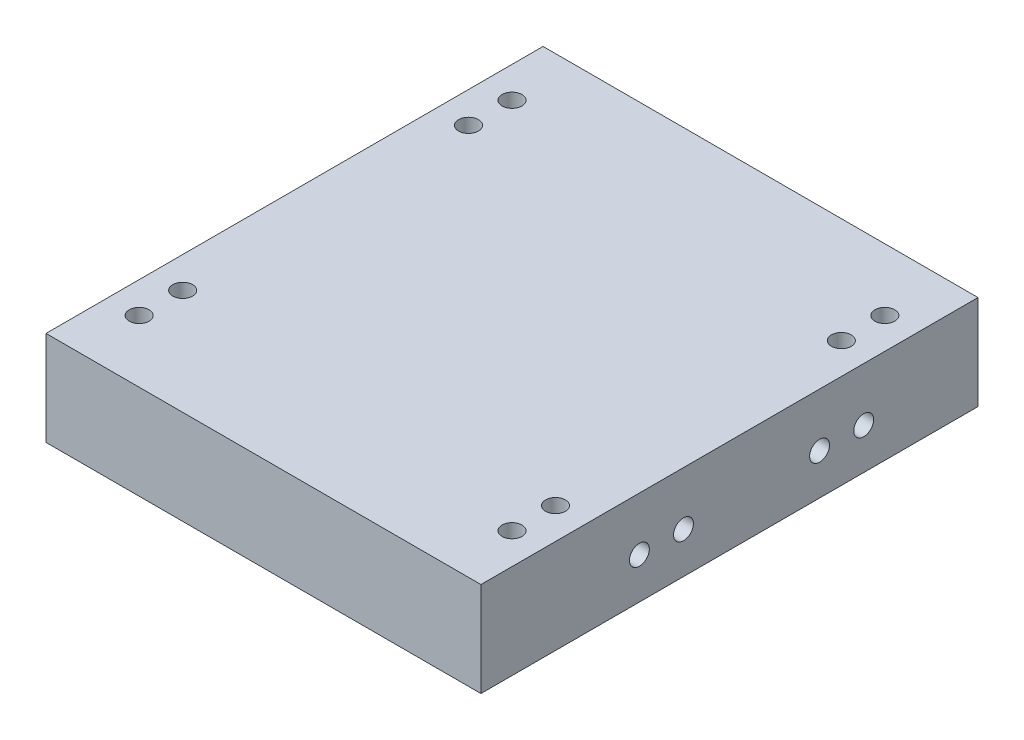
ISO-10303-21;
HEADER;
FILE_DESCRIPTION(('STEP AP214'),'2;1');
FILE_NAME('part.step','',(''),(''),'','','');
FILE_SCHEMA(('AUTOMOTIVE_DESIGN { 1 0 10303 214 1 1 1 1 }'));
ENDSEC;
DATA;
#1=APPLICATION_CONTEXT('core data for automotive mechanical design processes');
#2=APPLICATION_PROTOCOL_DEFINITION('international standard','automotive_design',2000,#1);
#3=PRODUCT_CONTEXT('',#1,'mechanical');
#4=PRODUCT('Part','Part','',(#3));
#5=PRODUCT_RELATED_PRODUCT_CATEGORY('part','',(#4));
#6=PRODUCT_DEFINITION_FORMATION('','',#4);
#7=PRODUCT_DEFINITION_CONTEXT('part definition',#1,'design');
#8=PRODUCT_DEFINITION('design','',#6,#7);
#9=PRODUCT_DEFINITION_SHAPE('','',#8);
#10=(LENGTH_UNIT() NAMED_UNIT(*) SI_UNIT(.MILLI.,.METRE.));
#11=(NAMED_UNIT(*) PLANE_ANGLE_UNIT() SI_UNIT($,.RADIAN.));
#12=(NAMED_UNIT(*) SI_UNIT($,.STERADIAN.) SOLID_ANGLE_UNIT());
#13=UNCERTAINTY_MEASURE_WITH_UNIT(LENGTH_MEASURE(1.E-05),#10,'distance_accuracy_value','');
#14=(GEOMETRIC_REPRESENTATION_CONTEXT(3) GLOBAL_UNCERTAINTY_ASSIGNED_CONTEXT((#13)) GLOBAL_UNIT_ASSIGNED_CONTEXT((#10,
#11,#12)) REPRESENTATION_CONTEXT('',''));
#15=CARTESIAN_POINT('',(0.,0.,0.));
#16=DIRECTION('',(0.,0.,1.));
#17=DIRECTION('',(1.,0.,0.));
#18=AXIS2_PLACEMENT_3D('',#15,#16,#17);
#19=CARTESIAN_POINT('',(22.225,9.652,-25.4));
#20=DIRECTION('',(-1.,0.,0.));
#21=DIRECTION('',(0.,0.,1.));
#22=AXIS2_PLACEMENT_3D('',#19,#20,#21);
#23=PLANE('',#22);
#24=CARTESIAN_POINT('',(22.225,4.19099999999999,9.2075));
#25=DIRECTION('',(1.,0.,0.));
#26=DIRECTION('',(0.,0.,-1.));
#27=AXIS2_PLACEMENT_3D('',#24,#25,#26);
#28=CIRCLE('',#27,1.016);
#29=CARTESIAN_POINT('',(22.225,4.19099999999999,8.1915));
#30=VERTEX_POINT('',#29);
#31=EDGE_CURVE('E163',#30,#30,#28,.T.);
#32=ORIENTED_EDGE('',*,*,#31,.F.);
#33=EDGE_LOOP('',(#32));
#34=FACE_BOUND('',#33,.T.);
#35=CARTESIAN_POINT('',(22.225,4.191,-9.2075));
#36=DIRECTION('',(1.,0.,0.));
#37=DIRECTION('',(0.,0.,-1.));
#38=AXIS2_PLACEMENT_3D('',#35,#36,#37);
#39=CIRCLE('',#38,1.016);
#40=CARTESIAN_POINT('',(22.225,4.191,-10.2235));
#41=VERTEX_POINT('',#40);
#42=EDGE_CURVE('E167',#41,#41,#39,.T.);
#43=ORIENTED_EDGE('',*,*,#42,.F.);
#44=EDGE_LOOP('',(#43));
#45=FACE_BOUND('',#44,.T.);
#46=CARTESIAN_POINT('',(22.225,4.191,4.699));
#47=DIRECTION('',(1.,0.,0.));
#48=DIRECTION('',(0.,0.,-1.));
#49=AXIS2_PLACEMENT_3D('',#46,#47,#48);
#50=CIRCLE('',#49,1.016);
#51=CARTESIAN_POINT('',(22.225,4.191,3.683));
#52=VERTEX_POINT('',#51);
#53=EDGE_CURVE('E171',#52,#52,#50,.T.);
#54=ORIENTED_EDGE('',*,*,#53,.F.);
#55=EDGE_LOOP('',(#54));
#56=FACE_BOUND('',#55,.T.);
#57=CARTESIAN_POINT('',(22.225,4.191,-13.716));
#58=DIRECTION('',(1.,0.,0.));
#59=DIRECTION('',(0.,0.,-1.));
#60=AXIS2_PLACEMENT_3D('',#57,#58,#59);
#61=CIRCLE('',#60,1.016);
#62=CARTESIAN_POINT('',(22.225,4.191,-14.732));
#63=VERTEX_POINT('',#62);
#64=EDGE_CURVE('E175',#63,#63,#61,.T.);
#65=ORIENTED_EDGE('',*,*,#64,.F.);
#66=EDGE_LOOP('',(#65));
#67=FACE_BOUND('',#66,.T.);
#68=DIRECTION('',(0.,0.,-1.));
#69=VECTOR('',#68,1.);
#70=CARTESIAN_POINT('',(22.225,0.,-25.4));
#71=LINE('',#70,#69);
#72=CARTESIAN_POINT('',(22.225,0.,25.4));
#73=VERTEX_POINT('',#72);
#74=CARTESIAN_POINT('',(22.225,0.,-25.4));
#75=VERTEX_POINT('',#74);
#76=EDGE_CURVE('E103',#73,#75,#71,.T.);
#77=ORIENTED_EDGE('',*,*,#76,.T.);
#78=DIRECTION('',(0.,-1.,0.));
#79=VECTOR('',#78,1.);
#80=CARTESIAN_POINT('',(22.225,9.652,-25.4));
#81=LINE('',#80,#79);
#82=CARTESIAN_POINT('',(22.225,9.652,-25.4));
#83=VERTEX_POINT('',#82);
#84=EDGE_CURVE('E11',#83,#75,#81,.T.);
#85=ORIENTED_EDGE('',*,*,#84,.F.);
#86=DIRECTION('',(0.,0.,-1.));
#87=VECTOR('',#86,1.);
#88=CARTESIAN_POINT('',(22.225,9.652,-25.4));
#89=LINE('',#88,#87);
#90=CARTESIAN_POINT('',(22.225,9.652,25.4));
#91=VERTEX_POINT('',#90);
#92=EDGE_CURVE('E90',#91,#83,#89,.T.);
#93=ORIENTED_EDGE('',*,*,#92,.F.);
#94=DIRECTION('',(0.,-1.,0.));
#95=VECTOR('',#94,1.);
#96=CARTESIAN_POINT('',(22.225,9.652,25.4));
#97=LINE('',#96,#95);
#98=EDGE_CURVE('E99',#91,#73,#97,.T.);
#99=ORIENTED_EDGE('',*,*,#98,.T.);
#100=EDGE_LOOP('',(#77,#85,#93,#99));
#101=FACE_BOUND('',#100,.T.);
#102=ADVANCED_FACE('F33',(#34,#45,#56,#67,#101),#23,.F.);
#103=CARTESIAN_POINT('',(-22.225,9.652,-25.4));
#104=DIRECTION('',(0.,0.,1.));
#105=DIRECTION('',(1.,0.,0.));
#106=AXIS2_PLACEMENT_3D('',#103,#104,#105);
#107=PLANE('',#106);
#108=DIRECTION('',(-1.,0.,0.));
#109=VECTOR('',#108,1.);
#110=CARTESIAN_POINT('',(-22.225,0.,-25.4));
#111=LINE('',#110,#109);
#112=CARTESIAN_POINT('',(-22.225,0.,-25.4));
#113=VERTEX_POINT('',#112);
#114=EDGE_CURVE('E94',#75,#113,#111,.T.);
#115=ORIENTED_EDGE('',*,*,#114,.T.);
#116=DIRECTION('',(0.,-1.,0.));
#117=VECTOR('',#116,1.);
#118=CARTESIAN_POINT('',(-22.225,9.652,-25.4));
#119=LINE('',#118,#117);
#120=CARTESIAN_POINT('',(-22.225,9.652,-25.4));
#121=VERTEX_POINT('',#120);
#122=EDGE_CURVE('E46',#121,#113,#119,.T.);
#123=ORIENTED_EDGE('',*,*,#122,.F.);
#124=DIRECTION('',(-1.,0.,0.));
#125=VECTOR('',#124,1.);
#126=CARTESIAN_POINT('',(-22.225,9.652,-25.4));
#127=LINE('',#126,#125);
#128=EDGE_CURVE('E85',#83,#121,#127,.T.);
#129=ORIENTED_EDGE('',*,*,#128,.F.);
#130=ORIENTED_EDGE('',*,*,#84,.T.);
#131=EDGE_LOOP('',(#115,#123,#129,#130));
#132=FACE_BOUND('',#131,.T.);
#133=ADVANCED_FACE('F93',(#132),#107,.F.);
#134=CARTESIAN_POINT('',(-22.225,9.652,-25.4));
#135=DIRECTION('',(1.,0.,0.));
#136=DIRECTION('',(0.,0.,-1.));
#137=AXIS2_PLACEMENT_3D('',#134,#135,#136);
#138=PLANE('',#137);
#139=CARTESIAN_POINT('',(-22.225,4.191,-9.2075));
#140=DIRECTION('',(-1.,0.,0.));
#141=DIRECTION('',(0.,0.,1.));
#142=AXIS2_PLACEMENT_3D('',#139,#140,#141);
#143=CIRCLE('',#142,1.016);
#144=CARTESIAN_POINT('',(-22.225,4.191,-8.1915));
#145=VERTEX_POINT('',#144);
#146=EDGE_CURVE('E205',#145,#145,#143,.T.);
#147=ORIENTED_EDGE('',*,*,#146,.F.);
#148=EDGE_LOOP('',(#147));
#149=FACE_BOUND('',#148,.T.);
#150=CARTESIAN_POINT('',(-22.225,4.191,9.2075));
#151=DIRECTION('',(-1.,0.,0.));
#152=DIRECTION('',(0.,0.,1.));
#153=AXIS2_PLACEMENT_3D('',#150,#151,#152);
#154=CIRCLE('',#153,1.016);
#155=CARTESIAN_POINT('',(-22.225,4.191,10.2235));
#156=VERTEX_POINT('',#155);
#157=EDGE_CURVE('E209',#156,#156,#154,.T.);
#158=ORIENTED_EDGE('',*,*,#157,.F.);
#159=EDGE_LOOP('',(#158));
#160=FACE_BOUND('',#159,.T.);
#161=CARTESIAN_POINT('',(-22.225,4.191,4.699));
#162=DIRECTION('',(-1.,0.,0.));
#163=DIRECTION('',(0.,0.,1.));
#164=AXIS2_PLACEMENT_3D('',#161,#162,#163);
#165=CIRCLE('',#164,1.016);
#166=CARTESIAN_POINT('',(-22.225,4.191,5.715));
#167=VERTEX_POINT('',#166);
#168=EDGE_CURVE('E213',#167,#167,#165,.T.);
#169=ORIENTED_EDGE('',*,*,#168,.F.);
#170=EDGE_LOOP('',(#169));
#171=FACE_BOUND('',#170,.T.);
#172=CARTESIAN_POINT('',(-22.225,4.191,-13.716));
#173=DIRECTION('',(-1.,0.,0.));
#174=DIRECTION('',(0.,0.,1.));
#175=AXIS2_PLACEMENT_3D('',#172,#173,#174);
#176=CIRCLE('',#175,1.016);
#177=CARTESIAN_POINT('',(-22.225,4.191,-12.7));
#178=VERTEX_POINT('',#177);
#179=EDGE_CURVE('E216',#178,#178,#176,.T.);
#180=ORIENTED_EDGE('',*,*,#179,.F.);
#181=EDGE_LOOP('',(#180));
#182=FACE_BOUND('',#181,.T.);
#183=DIRECTION('',(0.,0.,1.));
#184=VECTOR('',#183,1.);
#185=CARTESIAN_POINT('',(-22.225,0.,-25.4));
#186=LINE('',#185,#184);
#187=CARTESIAN_POINT('',(-22.225,0.,25.4));
#188=VERTEX_POINT('',#187);
#189=EDGE_CURVE('E72',#113,#188,#186,.T.);
#190=ORIENTED_EDGE('',*,*,#189,.T.);
#191=DIRECTION('',(0.,-1.,0.));
#192=VECTOR('',#191,1.);
#193=CARTESIAN_POINT('',(-22.225,9.652,25.4));
#194=LINE('',#193,#192);
#195=CARTESIAN_POINT('',(-22.225,9.652,25.4));
#196=VERTEX_POINT('',#195);
#197=EDGE_CURVE('E95',#196,#188,#194,.T.);
#198=ORIENTED_EDGE('',*,*,#197,.F.);
#199=DIRECTION('',(0.,0.,1.));
#200=VECTOR('',#199,1.);
#201=CARTESIAN_POINT('',(-22.225,9.652,-25.4));
#202=LINE('',#201,#200);
#203=EDGE_CURVE('E88',#121,#196,#202,.T.);
#204=ORIENTED_EDGE('',*,*,#203,.F.);
#205=ORIENTED_EDGE('',*,*,#122,.T.);
#206=EDGE_LOOP('',(#190,#198,#204,#205));
#207=FACE_BOUND('',#206,.T.);
#208=ADVANCED_FACE('F97',(#149,#160,#171,#182,#207),#138,.F.);
#209=CARTESIAN_POINT('',(-22.225,9.652,25.4));
#210=DIRECTION('',(0.,0.,-1.));
#211=DIRECTION('',(-1.,0.,0.));
#212=AXIS2_PLACEMENT_3D('',#209,#210,#211);
#213=PLANE('',#212);
#214=DIRECTION('',(1.,0.,0.));
#215=VECTOR('',#214,1.);
#216=CARTESIAN_POINT('',(-22.225,0.,25.4));
#217=LINE('',#216,#215);
#218=EDGE_CURVE('E78',#188,#73,#217,.T.);
#219=ORIENTED_EDGE('',*,*,#218,.T.);
#220=ORIENTED_EDGE('',*,*,#98,.F.);
#221=DIRECTION('',(1.,0.,0.));
#222=VECTOR('',#221,1.);
#223=CARTESIAN_POINT('',(-22.225,9.652,25.4));
#224=LINE('',#223,#222);
#225=EDGE_CURVE('E55',#196,#91,#224,.T.);
#226=ORIENTED_EDGE('',*,*,#225,.F.);
#227=ORIENTED_EDGE('',*,*,#197,.T.);
#228=EDGE_LOOP('',(#219,#220,#226,#227));
#229=FACE_BOUND('',#228,.T.);
#230=ADVANCED_FACE('F190',(#229),#213,.F.);
#231=CARTESIAN_POINT('',(0.,9.652,0.));
#232=DIRECTION('',(0.,1.,0.));
#233=DIRECTION('',(0.,0.,1.));
#234=AXIS2_PLACEMENT_3D('',#231,#232,#233);
#235=PLANE('',#234);
#236=CARTESIAN_POINT('',(-19.05,9.652,14.605));
#237=DIRECTION('',(0.,1.,0.));
#238=DIRECTION('',(0.,0.,1.));
#239=AXIS2_PLACEMENT_3D('',#236,#237,#238);
#240=CIRCLE('',#239,1.016);
#241=CARTESIAN_POINT('',(-19.05,9.652,15.621));
#242=VERTEX_POINT('',#241);
#243=EDGE_CURVE('E272',#242,#242,#240,.T.);
#244=ORIENTED_EDGE('',*,*,#243,.F.);
#245=EDGE_LOOP('',(#244));
#246=FACE_BOUND('',#245,.T.);
#247=CARTESIAN_POINT('',(19.05,9.652,-14.605));
#248=DIRECTION('',(0.,1.,0.));
#249=DIRECTION('',(0.,0.,1.));
#250=AXIS2_PLACEMENT_3D('',#247,#248,#249);
#251=CIRCLE('',#250,1.016);
#252=CARTESIAN_POINT('',(19.05,9.652,-13.589));
#253=VERTEX_POINT('',#252);
#254=EDGE_CURVE('E278',#253,#253,#251,.T.);
#255=ORIENTED_EDGE('',*,*,#254,.F.);
#256=EDGE_LOOP('',(#255));
#257=FACE_BOUND('',#256,.T.);
#258=CARTESIAN_POINT('',(-19.05,9.652,-14.605));
#259=DIRECTION('',(0.,1.,0.));
#260=DIRECTION('',(0.,0.,1.));
#261=AXIS2_PLACEMENT_3D('',#258,#259,#260);
#262=CIRCLE('',#261,1.016);
#263=CARTESIAN_POINT('',(-19.05,9.652,-13.589));
#264=VERTEX_POINT('',#263);
#265=EDGE_CURVE('E284',#264,#264,#262,.T.);
#266=ORIENTED_EDGE('',*,*,#265,.F.);
#267=EDGE_LOOP('',(#266));
#268=FACE_BOUND('',#267,.T.);
#269=CARTESIAN_POINT('',(19.05,9.652,14.605));
#270=DIRECTION('',(0.,1.,0.));
#271=DIRECTION('',(0.,0.,1.));
#272=AXIS2_PLACEMENT_3D('',#269,#270,#271);
#273=CIRCLE('',#272,1.016);
#274=CARTESIAN_POINT('',(19.05,9.652,15.621));
#275=VERTEX_POINT('',#274);
#276=EDGE_CURVE('E266',#275,#275,#273,.T.);
#277=ORIENTED_EDGE('',*,*,#276,.F.);
#278=EDGE_LOOP('',(#277));
#279=FACE_BOUND('',#278,.T.);
#280=CARTESIAN_POINT('',(19.05,9.652,19.05));
#281=DIRECTION('',(0.,1.,0.));
#282=DIRECTION('',(0.,0.,1.));
#283=AXIS2_PLACEMENT_3D('',#280,#281,#282);
#284=CIRCLE('',#283,1.016);
#285=CARTESIAN_POINT('',(19.05,9.652,20.066));
#286=VERTEX_POINT('',#285);
#287=EDGE_CURVE('E243',#286,#286,#284,.T.);
#288=ORIENTED_EDGE('',*,*,#287,.F.);
#289=EDGE_LOOP('',(#288));
#290=FACE_BOUND('',#289,.T.);
#291=CARTESIAN_POINT('',(19.05,9.652,-19.05));
#292=DIRECTION('',(0.,1.,0.));
#293=DIRECTION('',(0.,0.,1.));
#294=AXIS2_PLACEMENT_3D('',#291,#292,#293);
#295=CIRCLE('',#294,1.016);
#296=CARTESIAN_POINT('',(19.05,9.652,-18.034));
#297=VERTEX_POINT('',#296);
#298=EDGE_CURVE('E237',#297,#297,#295,.T.);
#299=ORIENTED_EDGE('',*,*,#298,.F.);
#300=EDGE_LOOP('',(#299));
#301=FACE_BOUND('',#300,.T.);
#302=CARTESIAN_POINT('',(-19.05,9.652,-19.05));
#303=DIRECTION('',(0.,1.,0.));
#304=DIRECTION('',(0.,0.,1.));
#305=AXIS2_PLACEMENT_3D('',#302,#303,#304);
#306=CIRCLE('',#305,1.016);
#307=CARTESIAN_POINT('',(-19.05,9.652,-18.034));
#308=VERTEX_POINT('',#307);
#309=EDGE_CURVE('E231',#308,#308,#306,.T.);
#310=ORIENTED_EDGE('',*,*,#309,.F.);
#311=EDGE_LOOP('',(#310));
#312=FACE_BOUND('',#311,.T.);
#313=CARTESIAN_POINT('',(-19.05,9.652,19.05));
#314=DIRECTION('',(0.,1.,0.));
#315=DIRECTION('',(0.,0.,1.));
#316=AXIS2_PLACEMENT_3D('',#313,#314,#315);
#317=CIRCLE('',#316,1.016);
#318=CARTESIAN_POINT('',(-19.05,9.652,20.066));
#319=VERTEX_POINT('',#318);
#320=EDGE_CURVE('E230',#319,#319,#317,.T.);
#321=ORIENTED_EDGE('',*,*,#320,.F.);
#322=EDGE_LOOP('',(#321));
#323=FACE_BOUND('',#322,.T.);
#324=ORIENTED_EDGE('',*,*,#92,.T.);
#325=ORIENTED_EDGE('',*,*,#128,.T.);
#326=ORIENTED_EDGE('',*,*,#203,.T.);
#327=ORIENTED_EDGE('',*,*,#225,.T.);
#328=EDGE_LOOP('',(#324,#325,#326,#327));
#329=FACE_BOUND('',#328,.T.);
#330=ADVANCED_FACE('F86',(#246,#257,#268,#279,#290,#301,#312,#323,#329),#235,.T.);
#331=CARTESIAN_POINT('',(0.,0.,0.));
#332=DIRECTION('',(0.,1.,0.));
#333=DIRECTION('',(0.,0.,1.));
#334=AXIS2_PLACEMENT_3D('',#331,#332,#333);
#335=PLANE('',#334);
#336=CARTESIAN_POINT('',(-19.05,0.,14.605));
#337=DIRECTION('',(0.,1.,0.));
#338=DIRECTION('',(0.,0.,1.));
#339=AXIS2_PLACEMENT_3D('',#336,#337,#338);
#340=CIRCLE('',#339,1.016);
#341=CARTESIAN_POINT('',(-19.05,0.,15.621));
#342=VERTEX_POINT('',#341);
#343=EDGE_CURVE('E275',#342,#342,#340,.T.);
#344=ORIENTED_EDGE('',*,*,#343,.T.);
#345=EDGE_LOOP('',(#344));
#346=FACE_BOUND('',#345,.T.);
#347=CARTESIAN_POINT('',(19.05,0.,-14.605));
#348=DIRECTION('',(0.,1.,0.));
#349=DIRECTION('',(0.,0.,1.));
#350=AXIS2_PLACEMENT_3D('',#347,#348,#349);
#351=CIRCLE('',#350,1.016);
#352=CARTESIAN_POINT('',(19.05,0.,-13.589));
#353=VERTEX_POINT('',#352);
#354=EDGE_CURVE('E281',#353,#353,#351,.T.);
#355=ORIENTED_EDGE('',*,*,#354,.T.);
#356=EDGE_LOOP('',(#355));
#357=FACE_BOUND('',#356,.T.);
#358=CARTESIAN_POINT('',(-19.05,0.,-14.605));
#359=DIRECTION('',(0.,1.,0.));
#360=DIRECTION('',(0.,0.,1.));
#361=AXIS2_PLACEMENT_3D('',#358,#359,#360);
#362=CIRCLE('',#361,1.016);
#363=CARTESIAN_POINT('',(-19.05,0.,-13.589));
#364=VERTEX_POINT('',#363);
#365=EDGE_CURVE('E269',#364,#364,#362,.T.);
#366=ORIENTED_EDGE('',*,*,#365,.T.);
#367=EDGE_LOOP('',(#366));
#368=FACE_BOUND('',#367,.T.);
#369=CARTESIAN_POINT('',(19.05,0.,14.605));
#370=DIRECTION('',(0.,1.,0.));
#371=DIRECTION('',(0.,0.,1.));
#372=AXIS2_PLACEMENT_3D('',#369,#370,#371);
#373=CIRCLE('',#372,1.016);
#374=CARTESIAN_POINT('',(19.05,0.,15.621));
#375=VERTEX_POINT('',#374);
#376=EDGE_CURVE('E117',#375,#375,#373,.T.);
#377=ORIENTED_EDGE('',*,*,#376,.T.);
#378=EDGE_LOOP('',(#377));
#379=FACE_BOUND('',#378,.T.);
#380=CARTESIAN_POINT('',(19.05,0.,19.05));
#381=DIRECTION('',(0.,1.,0.));
#382=DIRECTION('',(0.,0.,1.));
#383=AXIS2_PLACEMENT_3D('',#380,#381,#382);
#384=CIRCLE('',#383,1.016);
#385=CARTESIAN_POINT('',(19.05,0.,20.066));
#386=VERTEX_POINT('',#385);
#387=EDGE_CURVE('E240',#386,#386,#384,.T.);
#388=ORIENTED_EDGE('',*,*,#387,.T.);
#389=EDGE_LOOP('',(#388));
#390=FACE_BOUND('',#389,.T.);
#391=CARTESIAN_POINT('',(19.05,0.,-19.05));
#392=DIRECTION('',(0.,1.,0.));
#393=DIRECTION('',(0.,0.,1.));
#394=AXIS2_PLACEMENT_3D('',#391,#392,#393);
#395=CIRCLE('',#394,1.016);
#396=CARTESIAN_POINT('',(19.05,0.,-18.034));
#397=VERTEX_POINT('',#396);
#398=EDGE_CURVE('E234',#397,#397,#395,.T.);
#399=ORIENTED_EDGE('',*,*,#398,.T.);
#400=EDGE_LOOP('',(#399));
#401=FACE_BOUND('',#400,.T.);
#402=CARTESIAN_POINT('',(-19.05,0.,-19.05));
#403=DIRECTION('',(0.,1.,0.));
#404=DIRECTION('',(0.,0.,1.));
#405=AXIS2_PLACEMENT_3D('',#402,#403,#404);
#406=CIRCLE('',#405,1.016);
#407=CARTESIAN_POINT('',(-19.05,0.,-18.034));
#408=VERTEX_POINT('',#407);
#409=EDGE_CURVE('E227',#408,#408,#406,.T.);
#410=ORIENTED_EDGE('',*,*,#409,.T.);
#411=EDGE_LOOP('',(#410));
#412=FACE_BOUND('',#411,.T.);
#413=CARTESIAN_POINT('',(-19.05,0.,19.05));
#414=DIRECTION('',(0.,1.,0.));
#415=DIRECTION('',(0.,0.,1.));
#416=AXIS2_PLACEMENT_3D('',#413,#414,#415);
#417=CIRCLE('',#416,1.016);
#418=CARTESIAN_POINT('',(-19.05,0.,20.066));
#419=VERTEX_POINT('',#418);
#420=EDGE_CURVE('E106',#419,#419,#417,.T.);
#421=ORIENTED_EDGE('',*,*,#420,.T.);
#422=EDGE_LOOP('',(#421));
#423=FACE_BOUND('',#422,.T.);
#424=ORIENTED_EDGE('',*,*,#76,.F.);
#425=ORIENTED_EDGE('',*,*,#218,.F.);
#426=ORIENTED_EDGE('',*,*,#189,.F.);
#427=ORIENTED_EDGE('',*,*,#114,.F.);
#428=EDGE_LOOP('',(#424,#425,#426,#427));
#429=FACE_BOUND('',#428,.T.);
#430=ADVANCED_FACE('F178',(#346,#357,#368,#379,#390,#401,#412,#423,#429),#335,.F.);
#431=CARTESIAN_POINT('',(-19.05,0.,19.05));
#432=DIRECTION('',(0.,1.,0.));
#433=DIRECTION('',(0.,0.,1.));
#434=AXIS2_PLACEMENT_3D('',#431,#432,#433);
#435=CYLINDRICAL_SURFACE('',#434,1.016);
#436=ORIENTED_EDGE('',*,*,#420,.F.);
#437=EDGE_LOOP('',(#436));
#438=FACE_BOUND('',#437,.T.);
#439=ORIENTED_EDGE('',*,*,#320,.T.);
#440=EDGE_LOOP('',(#439));
#441=FACE_BOUND('',#440,.T.);
#442=ADVANCED_FACE('F180',(#438,#441),#435,.F.);
#443=CARTESIAN_POINT('',(-19.05,0.,-19.05));
#444=DIRECTION('',(0.,1.,0.));
#445=DIRECTION('',(0.,0.,1.));
#446=AXIS2_PLACEMENT_3D('',#443,#444,#445);
#447=CYLINDRICAL_SURFACE('',#446,1.016);
#448=ORIENTED_EDGE('',*,*,#409,.F.);
#449=EDGE_LOOP('',(#448));
#450=FACE_BOUND('',#449,.T.);
#451=ORIENTED_EDGE('',*,*,#309,.T.);
#452=EDGE_LOOP('',(#451));
#453=FACE_BOUND('',#452,.T.);
#454=ADVANCED_FACE('F187',(#450,#453),#447,.F.);
#455=CARTESIAN_POINT('',(19.05,0.,-19.05));
#456=DIRECTION('',(0.,1.,0.));
#457=DIRECTION('',(0.,0.,1.));
#458=AXIS2_PLACEMENT_3D('',#455,#456,#457);
#459=CYLINDRICAL_SURFACE('',#458,1.016);
#460=ORIENTED_EDGE('',*,*,#398,.F.);
#461=EDGE_LOOP('',(#460));
#462=FACE_BOUND('',#461,.T.);
#463=ORIENTED_EDGE('',*,*,#298,.T.);
#464=EDGE_LOOP('',(#463));
#465=FACE_BOUND('',#464,.T.);
#466=ADVANCED_FACE('F467',(#462,#465),#459,.F.);
#467=CARTESIAN_POINT('',(19.05,0.,19.05));
#468=DIRECTION('',(0.,1.,0.));
#469=DIRECTION('',(0.,0.,1.));
#470=AXIS2_PLACEMENT_3D('',#467,#468,#469);
#471=CYLINDRICAL_SURFACE('',#470,1.016);
#472=ORIENTED_EDGE('',*,*,#387,.F.);
#473=EDGE_LOOP('',(#472));
#474=FACE_BOUND('',#473,.T.);
#475=ORIENTED_EDGE('',*,*,#287,.T.);
#476=EDGE_LOOP('',(#475));
#477=FACE_BOUND('',#476,.T.);
#478=ADVANCED_FACE('F460',(#474,#477),#471,.F.);
#479=CARTESIAN_POINT('',(-12.065,4.191,-13.716));
#480=DIRECTION('',(-1.,0.,0.));
#481=DIRECTION('',(0.,0.,1.));
#482=AXIS2_PLACEMENT_3D('',#479,#480,#481);
#483=CYLINDRICAL_SURFACE('',#482,1.016);
#484=CARTESIAN_POINT('',(-19.05,3.18296875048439,-13.589));
#485=CARTESIAN_POINT('',(-19.1069224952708,3.18296383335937,-13.5890028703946));
#486=CARTESIAN_POINT('',(-19.1639101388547,3.18232753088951,-13.5938030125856));
#487=CARTESIAN_POINT('',(-19.2763399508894,3.18020247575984,-13.6128862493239));
#488=CARTESIAN_POINT('',(-19.3317786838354,3.17871196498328,-13.6271889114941));
#489=CARTESIAN_POINT('',(-19.4394718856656,3.17611161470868,-13.6648833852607));
#490=CARTESIAN_POINT('',(-19.4917276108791,3.1750016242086,-13.6882715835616));
#491=CARTESIAN_POINT('',(-19.5915812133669,3.17499838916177,-13.7434911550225));
#492=CARTESIAN_POINT('',(-19.6391805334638,3.17610445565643,-13.7753199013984));
#493=CARTESIAN_POINT('',(-19.7272690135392,3.18269790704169,-13.8456139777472));
#494=CARTESIAN_POINT('',(-19.7678874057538,3.18809200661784,-13.8839244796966));
#495=CARTESIAN_POINT('',(-19.8416950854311,3.20532062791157,-13.9658605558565));
#496=CARTESIAN_POINT('',(-19.8748974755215,3.21714366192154,-14.0094765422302));
#497=CARTESIAN_POINT('',(-19.9288149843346,3.24667302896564,-14.0930757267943));
#498=CARTESIAN_POINT('',(-19.9506232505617,3.26333617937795,-14.1327239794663));
#499=CARTESIAN_POINT('',(-19.9878468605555,3.30308483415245,-14.2117983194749));
#500=CARTESIAN_POINT('',(-20.0032637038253,3.32616882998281,-14.2512244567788));
#501=CARTESIAN_POINT('',(-20.0271360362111,3.37611302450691,-14.3242734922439));
#502=CARTESIAN_POINT('',(-20.03609440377,3.40244404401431,-14.358098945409));
#503=CARTESIAN_POINT('',(-20.0500315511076,3.45964673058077,-14.4225670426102));
#504=CARTESIAN_POINT('',(-20.0550092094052,3.49051967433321,-14.4532087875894));
#505=CARTESIAN_POINT('',(-20.0622838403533,3.55880520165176,-14.5127448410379));
#506=CARTESIAN_POINT('',(-20.0643285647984,3.59654600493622,-14.5412918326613));
#507=CARTESIAN_POINT('',(-20.0662562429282,3.67566921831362,-14.5928837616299));
#508=CARTESIAN_POINT('',(-20.0661378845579,3.7170538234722,-14.6159253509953));
#509=CARTESIAN_POINT('',(-20.0648298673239,3.80876741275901,-14.6589059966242));
#510=CARTESIAN_POINT('',(-20.063488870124,3.85952758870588,-14.6779249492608));
#511=CARTESIAN_POINT('',(-20.0609108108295,3.96342732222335,-14.7076595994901));
#512=CARTESIAN_POINT('',(-20.0596737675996,4.01656730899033,-14.7183737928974));
#513=CARTESIAN_POINT('',(-20.0581085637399,4.12692476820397,-14.7315823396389));
#514=CARTESIAN_POINT('',(-20.057835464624,4.18420341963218,-14.7335802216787));
#515=CARTESIAN_POINT('',(-20.058538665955,4.2982770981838,-14.7279339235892));
#516=CARTESIAN_POINT('',(-20.0595151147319,4.35507206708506,-14.7202885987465));
#517=CARTESIAN_POINT('',(-20.0620218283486,4.46624019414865,-14.6956541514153));
#518=CARTESIAN_POINT('',(-20.0635489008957,4.52062532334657,-14.6787186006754));
#519=CARTESIAN_POINT('',(-20.0657514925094,4.62585616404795,-14.6359901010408));
#520=CARTESIAN_POINT('',(-20.0664266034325,4.67670016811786,-14.6101929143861));
#521=CARTESIAN_POINT('',(-20.0649718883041,4.7735222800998,-14.5503685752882));
#522=CARTESIAN_POINT('',(-20.0628327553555,4.81948369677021,-14.5163144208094));
#523=CARTESIAN_POINT('',(-20.0534304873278,4.90474337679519,-14.4412839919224));
#524=CARTESIAN_POINT('',(-20.0461746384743,4.94405101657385,-14.4003176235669));
#525=CARTESIAN_POINT('',(-20.0254608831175,5.010941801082,-14.3180532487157));
#526=CARTESIAN_POINT('',(-20.0127161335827,5.03931430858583,-14.2772210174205));
#527=CARTESIAN_POINT('',(-19.9802275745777,5.08883428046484,-14.1940042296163));
#528=CARTESIAN_POINT('',(-19.960490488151,5.10998864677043,-14.1516211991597));
#529=CARTESIAN_POINT('',(-19.9169129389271,5.14282610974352,-14.0735435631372));
#530=CARTESIAN_POINT('',(-19.8939729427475,5.15539697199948,-14.0377118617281));
#531=CARTESIAN_POINT('',(-19.8430030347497,5.17581142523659,-13.9684053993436));
#532=CARTESIAN_POINT('',(-19.8149717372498,5.18365372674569,-13.9349312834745));
#533=CARTESIAN_POINT('',(-19.7537263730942,5.19568060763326,-13.8708069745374));
#534=CARTESIAN_POINT('',(-19.720404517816,5.19977335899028,-13.8402433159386));
#535=CARTESIAN_POINT('',(-19.6498551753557,5.20513748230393,-13.7837351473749));
#536=CARTESIAN_POINT('',(-19.6126258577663,5.20640752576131,-13.7577928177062));
#537=CARTESIAN_POINT('',(-19.5295365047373,5.20731763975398,-13.7077983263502));
#538=CARTESIAN_POINT('',(-19.4832003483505,5.20670194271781,-13.6845316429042));
#539=CARTESIAN_POINT('',(-19.3875384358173,5.20472856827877,-13.6453125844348));
#540=CARTESIAN_POINT('',(-19.338211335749,5.20337055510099,-13.6293635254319));
#541=CARTESIAN_POINT('',(-19.2328084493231,5.2008954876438,-13.6039754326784));
#542=CARTESIAN_POINT('',(-19.1765417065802,5.19981450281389,-13.595316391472));
#543=CARTESIAN_POINT('',(-19.0633470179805,5.19884951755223,-13.5875044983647));
#544=CARTESIAN_POINT('',(-19.0064190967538,5.19896547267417,-13.588351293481));
#545=CARTESIAN_POINT('',(-18.8934441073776,5.20031721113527,-13.5995287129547));
#546=CARTESIAN_POINT('',(-18.8373982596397,5.2015544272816,-13.6098714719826));
#547=CARTESIAN_POINT('',(-18.7277976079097,5.20424622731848,-13.6397692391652));
#548=CARTESIAN_POINT('',(-18.6742440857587,5.20570092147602,-13.6593289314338));
#549=CARTESIAN_POINT('',(-18.5707885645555,5.20724695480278,-13.7072896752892));
#550=CARTESIAN_POINT('',(-18.5209127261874,5.20732931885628,-13.7357476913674));
#551=CARTESIAN_POINT('',(-18.4267306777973,5.20398946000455,-13.8006041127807));
#552=CARTESIAN_POINT('',(-18.3824212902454,5.20056924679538,-13.836997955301));
#553=CARTESIAN_POINT('',(-18.3031760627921,5.18822635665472,-13.914064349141));
#554=CARTESIAN_POINT('',(-18.2678582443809,5.17961727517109,-13.9543906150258));
#555=CARTESIAN_POINT('',(-18.204834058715,5.15538375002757,-14.038689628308));
#556=CARTESIAN_POINT('',(-18.1771151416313,5.13977098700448,-14.0826562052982));
#557=CARTESIAN_POINT('',(-18.1333418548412,5.10346777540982,-14.1647365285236));
#558=CARTESIAN_POINT('',(-18.116164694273,5.08388098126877,-14.2027459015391));
#559=CARTESIAN_POINT('',(-18.0874219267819,5.03890823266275,-14.277431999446));
#560=CARTESIAN_POINT('',(-18.0758570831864,5.01352149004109,-14.3141085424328));
#561=CARTESIAN_POINT('',(-18.0579347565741,4.95860804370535,-14.3830061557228));
#562=CARTESIAN_POINT('',(-18.0513827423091,4.92929444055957,-14.4153484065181));
#563=CARTESIAN_POINT('',(-18.0417233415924,4.86645724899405,-14.4762166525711));
#564=CARTESIAN_POINT('',(-18.0386170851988,4.83293228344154,-14.5047413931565));
#565=CARTESIAN_POINT('',(-18.0345555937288,4.75825568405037,-14.5603277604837));
#566=CARTESIAN_POINT('',(-18.0338945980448,4.71667065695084,-14.5868275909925));
#567=CARTESIAN_POINT('',(-18.0341318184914,4.63010274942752,-14.6335337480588));
#568=CARTESIAN_POINT('',(-18.0350309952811,4.58511779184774,-14.6537361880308));
#569=CARTESIAN_POINT('',(-18.0373469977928,4.48670519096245,-14.6896005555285));
#570=CARTESIAN_POINT('',(-18.0388157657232,4.43293847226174,-14.7043361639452));
#571=CARTESIAN_POINT('',(-18.0410378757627,4.3237099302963,-14.7248274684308));
#572=CARTESIAN_POINT('',(-18.0417912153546,4.26824810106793,-14.7305831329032));
#573=CARTESIAN_POINT('',(-18.0420918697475,4.15568105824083,-14.7329847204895));
#574=CARTESIAN_POINT('',(-18.0416074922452,4.09857043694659,-14.7293912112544));
#575=CARTESIAN_POINT('',(-18.0396891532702,3.98576276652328,-14.7126880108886));
#576=CARTESIAN_POINT('',(-18.0382548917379,3.93006616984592,-14.6995753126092));
#577=CARTESIAN_POINT('',(-18.035574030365,3.82172066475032,-14.6642257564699));
#578=CARTESIAN_POINT('',(-18.0343271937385,3.7690679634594,-14.6420005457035));
#579=CARTESIAN_POINT('',(-18.0337815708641,3.66819050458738,-14.5890234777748));
#580=CARTESIAN_POINT('',(-18.0344831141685,3.61996649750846,-14.5582701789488));
#581=CARTESIAN_POINT('',(-18.0399845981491,3.53013994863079,-14.4897320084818));
#582=CARTESIAN_POINT('',(-18.0447236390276,3.48844985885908,-14.4520581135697));
#583=CARTESIAN_POINT('',(-18.0604455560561,3.41240129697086,-14.3710645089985));
#584=CARTESIAN_POINT('',(-18.0714170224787,3.37802958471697,-14.3277552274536));
#585=CARTESIAN_POINT('',(-18.0993705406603,3.32178162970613,-14.2441198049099));
#586=CARTESIAN_POINT('',(-18.1153524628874,3.29884901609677,-14.2041693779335));
#587=CARTESIAN_POINT('',(-18.1538674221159,3.2595442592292,-14.1242024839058));
#588=CARTESIAN_POINT('',(-18.1763983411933,3.24316999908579,-14.0841860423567));
#589=CARTESIAN_POINT('',(-18.2252326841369,3.21781985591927,-14.0102031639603));
#590=CARTESIAN_POINT('',(-18.2509353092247,3.20826875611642,-13.9760314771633));
#591=CARTESIAN_POINT('',(-18.3069662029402,3.19327305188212,-13.9107314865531));
#592=CARTESIAN_POINT('',(-18.33729540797,3.1878292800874,-13.8796038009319));
#593=CARTESIAN_POINT('',(-18.404235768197,3.17976664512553,-13.8192388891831));
#594=CARTESIAN_POINT('',(-18.4411421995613,3.17737977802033,-13.7902998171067));
#595=CARTESIAN_POINT('',(-18.5186596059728,3.17489134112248,-13.737745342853));
#596=CARTESIAN_POINT('',(-18.5592740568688,3.17479193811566,-13.7141350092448));
#597=CARTESIAN_POINT('',(-18.6494855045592,3.17577581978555,-13.6697322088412));
#598=CARTESIAN_POINT('',(-18.6995295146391,3.17703334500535,-13.6498500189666));
#599=CARTESIAN_POINT('',(-18.8020728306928,3.17958683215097,-13.6182580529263));
#600=CARTESIAN_POINT('',(-18.8545684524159,3.18088273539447,-13.6065364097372));
#601=CARTESIAN_POINT('',(-18.9311961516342,3.18214436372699,-13.5956881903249));
#602=CARTESIAN_POINT('',(-18.9548837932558,3.18244910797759,-13.5931821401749));
#603=CARTESIAN_POINT('',(-19.0023771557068,3.1828623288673,-13.5898374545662));
#604=CARTESIAN_POINT('',(-19.0261828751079,3.18297080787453,-13.588998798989));
#605=CARTESIAN_POINT('',(-19.05,3.18296875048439,-13.589));
#606=B_SPLINE_CURVE_WITH_KNOTS('',3,(#484,#485,#486,#487,#488,#489,#490,#491,#492,#493,#494,
#495,#496,#497,#498,#499,#500,#501,#502,#503,#504,#505,#506,#507,#508,#509,#510,#511,#512,#513,
#514,#515,#516,#517,#518,#519,#520,#521,#522,#523,#524,#525,#526,#527,#528,#529,#530,#531,#532,
#533,#534,#535,#536,#537,#538,#539,#540,#541,#542,#543,#544,#545,#546,#547,#548,#549,#550,#551,
#552,#553,#554,#555,#556,#557,#558,#559,#560,#561,#562,#563,#564,#565,#566,#567,#568,#569,#570,
#571,#572,#573,#574,#575,#576,#577,#578,#579,#580,#581,#582,#583,#584,#585,#586,#587,#588,#589,
#590,#591,#592,#593,#594,#595,#596,#597,#598,#599,#600,#601,#602,#603,#604,#605),.UNSPECIFIED.,
.T.,.F.,(4,2,2,2,2,2,2,2,2,2,2,2,2,2,2,2,2,2,2,2,2,2,2,2,2,2,2,2,2,2,2,2,2,2,2,2,2,2,2,2,2,2,2,
2,2,2,2,2,2,2,2,2,2,2,2,2,2,2,2,2,4),(0.,0.170678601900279,0.341709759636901,0.512672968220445,
0.683583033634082,0.850873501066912,1.01786601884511,1.16170175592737,1.30550372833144,
1.43632112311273,1.56717535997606,1.70872079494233,1.85035208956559,2.01231347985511,
2.17430419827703,2.34541041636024,2.51653694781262,2.68668690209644,2.85691833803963,
3.02771415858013,3.19826725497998,3.35131172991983,3.50420945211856,3.63668054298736,
3.76918774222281,3.90485952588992,4.04059514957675,4.19551670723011,4.35050839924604,
4.52050935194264,4.69050399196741,4.86071616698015,5.03101493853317,5.20242703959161,
5.37374084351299,5.53561450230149,5.69721918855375,5.83473713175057,5.97227377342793,
6.10415623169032,6.23608192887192,6.38344514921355,6.53089913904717,6.69744121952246,
6.86398388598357,7.03483344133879,7.20573699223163,7.37642278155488,7.54713744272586,
7.71532180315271,7.88319925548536,8.02862414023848,8.17400204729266,8.30487310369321,
8.43577068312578,8.57610674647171,8.7165757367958,8.87748935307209,9.03816847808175,
9.10958352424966,9.18099770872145),.UNSPECIFIED.);
#607=CARTESIAN_POINT('',(-19.05,3.18296875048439,-13.589));
#608=VERTEX_POINT('',#607);
#609=EDGE_CURVE('E36',#608,#608,#606,.T.);
#610=ORIENTED_EDGE('',*,*,#609,.T.);
#611=EDGE_LOOP('',(#610));
#612=FACE_BOUND('',#611,.T.);
#613=CARTESIAN_POINT('',(-12.065,4.191,-13.716));
#614=DIRECTION('',(-1.,0.,0.));
#615=DIRECTION('',(0.,0.,1.));
#616=AXIS2_PLACEMENT_3D('',#613,#614,#615);
#617=CIRCLE('',#616,1.016);
#618=CARTESIAN_POINT('',(-12.065,4.191,-12.7));
#619=VERTEX_POINT('',#618);
#620=EDGE_CURVE('E218',#619,#619,#617,.T.);
#621=ORIENTED_EDGE('',*,*,#620,.F.);
#622=EDGE_LOOP('',(#621));
#623=FACE_BOUND('',#622,.T.);
#624=ORIENTED_EDGE('',*,*,#179,.T.);
#625=EDGE_LOOP('',(#624));
#626=FACE_BOUND('',#625,.T.);
#627=ADVANCED_FACE('F451',(#612,#623,#626),#483,.F.);
#628=CARTESIAN_POINT('',(-12.065,4.191,-13.716));
#629=DIRECTION('',(-1.,0.,0.));
#630=DIRECTION('',(0.,0.,1.));
#631=AXIS2_PLACEMENT_3D('',#628,#629,#630);
#632=PLANE('',#631);
#633=ORIENTED_EDGE('',*,*,#620,.T.);
#634=EDGE_LOOP('',(#633));
#635=FACE_BOUND('',#634,.T.);
#636=ADVANCED_FACE('F442',(#635),#632,.T.);
#637=CARTESIAN_POINT('',(-12.065,4.191,4.699));
#638=DIRECTION('',(-1.,0.,0.));
#639=DIRECTION('',(0.,0.,1.));
#640=AXIS2_PLACEMENT_3D('',#637,#638,#639);
#641=CYLINDRICAL_SURFACE('',#640,1.016);
#642=CARTESIAN_POINT('',(-12.065,4.191,4.699));
#643=DIRECTION('',(-1.,0.,0.));
#644=DIRECTION('',(0.,0.,1.));
#645=AXIS2_PLACEMENT_3D('',#642,#643,#644);
#646=CIRCLE('',#645,1.016);
#647=CARTESIAN_POINT('',(-12.065,4.191,5.715));
#648=VERTEX_POINT('',#647);
#649=EDGE_CURVE('E246',#648,#648,#646,.T.);
#650=ORIENTED_EDGE('',*,*,#649,.F.);
#651=EDGE_LOOP('',(#650));
#652=FACE_BOUND('',#651,.T.);
#653=ORIENTED_EDGE('',*,*,#168,.T.);
#654=EDGE_LOOP('',(#653));
#655=FACE_BOUND('',#654,.T.);
#656=ADVANCED_FACE('F435',(#652,#655),#641,.F.);
#657=CARTESIAN_POINT('',(-12.065,4.191,4.699));
#658=DIRECTION('',(-1.,0.,0.));
#659=DIRECTION('',(0.,0.,1.));
#660=AXIS2_PLACEMENT_3D('',#657,#658,#659);
#661=PLANE('',#660);
#662=ORIENTED_EDGE('',*,*,#649,.T.);
#663=EDGE_LOOP('',(#662));
#664=FACE_BOUND('',#663,.T.);
#665=ADVANCED_FACE('F152',(#664),#661,.T.);
#666=CARTESIAN_POINT('',(12.065,4.191,-13.716));
#667=DIRECTION('',(1.,0.,0.));
#668=DIRECTION('',(0.,0.,-1.));
#669=AXIS2_PLACEMENT_3D('',#666,#667,#668);
#670=CYLINDRICAL_SURFACE('',#669,1.016);
#671=CARTESIAN_POINT('',(18.0419687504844,4.191,-14.732));
#672=CARTESIAN_POINT('',(18.0419638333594,4.24792249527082,-14.7319971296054));
#673=CARTESIAN_POINT('',(18.0413275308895,4.30491013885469,-14.7271969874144));
#674=CARTESIAN_POINT('',(18.0392024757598,4.41733995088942,-14.7081137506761));
#675=CARTESIAN_POINT('',(18.0377119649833,4.47277868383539,-14.6938110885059));
#676=CARTESIAN_POINT('',(18.0351116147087,4.58047188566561,-14.6561166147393));
#677=CARTESIAN_POINT('',(18.0340016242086,4.6327276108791,-14.6327284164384));
#678=CARTESIAN_POINT('',(18.0339983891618,4.73258121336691,-14.5775088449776));
#679=CARTESIAN_POINT('',(18.0351044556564,4.78018053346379,-14.5456800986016));
#680=CARTESIAN_POINT('',(18.0416979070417,4.86826901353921,-14.4753860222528));
#681=CARTESIAN_POINT('',(18.0470920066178,4.9088874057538,-14.4370755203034));
#682=CARTESIAN_POINT('',(18.0643206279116,4.98269508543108,-14.3551394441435));
#683=CARTESIAN_POINT('',(18.0761436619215,5.01589747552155,-14.3115234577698));
#684=CARTESIAN_POINT('',(18.1056730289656,5.06981498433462,-14.2279242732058));
#685=CARTESIAN_POINT('',(18.1223361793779,5.09162325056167,-14.1882760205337));
#686=CARTESIAN_POINT('',(18.1620848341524,5.12884686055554,-14.1092016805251));
#687=CARTESIAN_POINT('',(18.1851688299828,5.14426370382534,-14.0697755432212));
#688=CARTESIAN_POINT('',(18.2351130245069,5.16813603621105,-13.9967265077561));
#689=CARTESIAN_POINT('',(18.2614440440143,5.17709440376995,-13.962901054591));
#690=CARTESIAN_POINT('',(18.3186467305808,5.19103155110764,-13.8984329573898));
#691=CARTESIAN_POINT('',(18.3495196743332,5.19600920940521,-13.8677912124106));
#692=CARTESIAN_POINT('',(18.4178052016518,5.20328384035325,-13.8082551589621));
#693=CARTESIAN_POINT('',(18.4555460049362,5.2053285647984,-13.7797081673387));
#694=CARTESIAN_POINT('',(18.5346692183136,5.20725624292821,-13.7281162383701));
#695=CARTESIAN_POINT('',(18.5760538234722,5.20713788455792,-13.7050746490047));
#696=CARTESIAN_POINT('',(18.667767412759,5.20582986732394,-13.6620940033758));
#697=CARTESIAN_POINT('',(18.7185275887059,5.20448887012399,-13.6430750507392));
#698=CARTESIAN_POINT('',(18.8224273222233,5.20191081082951,-13.6133404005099));
#699=CARTESIAN_POINT('',(18.8755673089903,5.20067376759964,-13.6026262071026));
#700=CARTESIAN_POINT('',(18.985924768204,5.19910856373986,-13.5894176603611));
#701=CARTESIAN_POINT('',(19.0432034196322,5.19883546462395,-13.5874197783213));
#702=CARTESIAN_POINT('',(19.1572770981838,5.19953866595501,-13.5930660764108));
#703=CARTESIAN_POINT('',(19.2140720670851,5.20051511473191,-13.6007114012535));
#704=CARTESIAN_POINT('',(19.3252401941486,5.20302182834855,-13.6253458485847));
#705=CARTESIAN_POINT('',(19.3796253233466,5.20454890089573,-13.6422813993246));
#706=CARTESIAN_POINT('',(19.4848561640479,5.2067514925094,-13.6850098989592));
#707=CARTESIAN_POINT('',(19.5357001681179,5.20742660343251,-13.7108070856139));
#708=CARTESIAN_POINT('',(19.6325222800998,5.20597188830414,-13.7706314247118));
#709=CARTESIAN_POINT('',(19.6784836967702,5.20383275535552,-13.8046855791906));
#710=CARTESIAN_POINT('',(19.7637433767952,5.19443048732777,-13.8797160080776));
#711=CARTESIAN_POINT('',(19.8030510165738,5.18717463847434,-13.9206823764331));
#712=CARTESIAN_POINT('',(19.869941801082,5.16646088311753,-14.0029467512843));
#713=CARTESIAN_POINT('',(19.8983143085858,5.15371613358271,-14.0437789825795));
#714=CARTESIAN_POINT('',(19.9478342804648,5.12122757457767,-14.1269957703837));
#715=CARTESIAN_POINT('',(19.9689886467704,5.10149048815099,-14.1693788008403));
#716=CARTESIAN_POINT('',(20.0018261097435,5.05791293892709,-14.2474564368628));
#717=CARTESIAN_POINT('',(20.0143969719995,5.0349729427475,-14.2832881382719));
#718=CARTESIAN_POINT('',(20.0348114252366,4.98400303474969,-14.3525946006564));
#719=CARTESIAN_POINT('',(20.0426537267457,4.95597173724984,-14.3860687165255));
#720=CARTESIAN_POINT('',(20.0546806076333,4.89472637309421,-14.4501930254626));
#721=CARTESIAN_POINT('',(20.0587733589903,4.86140451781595,-14.4807566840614));
#722=CARTESIAN_POINT('',(20.0641374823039,4.79085517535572,-14.5372648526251));
#723=CARTESIAN_POINT('',(20.0654075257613,4.75362585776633,-14.5632071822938));
#724=CARTESIAN_POINT('',(20.066317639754,4.6705365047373,-14.6132016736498));
#725=CARTESIAN_POINT('',(20.0657019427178,4.62420034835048,-14.6364683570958));
#726=CARTESIAN_POINT('',(20.0637285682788,4.5285384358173,-14.6756874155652));
#727=CARTESIAN_POINT('',(20.062370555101,4.47921133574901,-14.6916364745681));
#728=CARTESIAN_POINT('',(20.0598954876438,4.37380844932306,-14.7170245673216));
#729=CARTESIAN_POINT('',(20.0588145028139,4.31754170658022,-14.725683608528));
#730=CARTESIAN_POINT('',(20.0578495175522,4.2043470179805,-14.7334955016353));
#731=CARTESIAN_POINT('',(20.0579654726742,4.14741909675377,-14.732648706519));
#732=CARTESIAN_POINT('',(20.0593172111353,4.03444410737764,-14.7214712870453));
#733=CARTESIAN_POINT('',(20.0605544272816,3.97839825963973,-14.7111285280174));
#734=CARTESIAN_POINT('',(20.0632462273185,3.86879760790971,-14.6812307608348));
#735=CARTESIAN_POINT('',(20.064700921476,3.81524408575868,-14.6616710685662));
#736=CARTESIAN_POINT('',(20.0662469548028,3.71178856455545,-14.6137103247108));
#737=CARTESIAN_POINT('',(20.0663293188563,3.66191272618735,-14.5852523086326));
#738=CARTESIAN_POINT('',(20.0629894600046,3.56773067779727,-14.5203958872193));
#739=CARTESIAN_POINT('',(20.0595692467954,3.52342129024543,-14.484002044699));
#740=CARTESIAN_POINT('',(20.0472263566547,3.44417606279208,-14.406935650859));
#741=CARTESIAN_POINT('',(20.0386172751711,3.40885824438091,-14.3666093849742));
#742=CARTESIAN_POINT('',(20.0143837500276,3.34583405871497,-14.282310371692));
#743=CARTESIAN_POINT('',(19.9987709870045,3.3181151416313,-14.2383437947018));
#744=CARTESIAN_POINT('',(19.9624677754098,3.27434185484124,-14.1562634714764));
#745=CARTESIAN_POINT('',(19.9428809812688,3.25716469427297,-14.1182540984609));
#746=CARTESIAN_POINT('',(19.8979082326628,3.22842192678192,-14.043568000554));
#747=CARTESIAN_POINT('',(19.8725214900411,3.21685708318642,-14.0068914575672));
#748=CARTESIAN_POINT('',(19.8176080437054,3.1989347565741,-13.9379938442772));
#749=CARTESIAN_POINT('',(19.7882944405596,3.19238274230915,-13.9056515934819));
#750=CARTESIAN_POINT('',(19.7254572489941,3.18272334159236,-13.8447833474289));
#751=CARTESIAN_POINT('',(19.6919322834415,3.17961708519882,-13.8162586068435));
#752=CARTESIAN_POINT('',(19.6172556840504,3.17555559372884,-13.7606722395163));
#753=CARTESIAN_POINT('',(19.5756706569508,3.17489459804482,-13.7341724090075));
#754=CARTESIAN_POINT('',(19.4891027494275,3.1751318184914,-13.6874662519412));
#755=CARTESIAN_POINT('',(19.4441177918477,3.17603099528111,-13.6672638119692));
#756=CARTESIAN_POINT('',(19.3457051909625,3.17834699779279,-13.6313994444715));
#757=CARTESIAN_POINT('',(19.2919384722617,3.17981576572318,-13.6166638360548));
#758=CARTESIAN_POINT('',(19.1827099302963,3.18203787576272,-13.5961725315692));
#759=CARTESIAN_POINT('',(19.1272481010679,3.1827912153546,-13.5904168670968));
#760=CARTESIAN_POINT('',(19.0146810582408,3.18309186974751,-13.5880152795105));
#761=CARTESIAN_POINT('',(18.9575704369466,3.18260749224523,-13.5916087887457));
#762=CARTESIAN_POINT('',(18.8447627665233,3.18068915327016,-13.6083119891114));
#763=CARTESIAN_POINT('',(18.7890661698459,3.17925489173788,-13.6214246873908));
#764=CARTESIAN_POINT('',(18.6807206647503,3.17657403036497,-13.6567742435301));
#765=CARTESIAN_POINT('',(18.6280679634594,3.17532719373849,-13.6789994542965));
#766=CARTESIAN_POINT('',(18.5271905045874,3.17478157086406,-13.7319765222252));
#767=CARTESIAN_POINT('',(18.4789664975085,3.17548311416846,-13.7627298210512));
#768=CARTESIAN_POINT('',(18.3891399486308,3.18098459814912,-13.8312679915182));
#769=CARTESIAN_POINT('',(18.3474498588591,3.18572363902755,-13.8689418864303));
#770=CARTESIAN_POINT('',(18.2714012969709,3.20144555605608,-13.9499354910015));
#771=CARTESIAN_POINT('',(18.237029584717,3.21241702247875,-13.9932447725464));
#772=CARTESIAN_POINT('',(18.1807816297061,3.24037054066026,-14.0768801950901));
#773=CARTESIAN_POINT('',(18.1578490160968,3.25635246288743,-14.1168306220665));
#774=CARTESIAN_POINT('',(18.1185442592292,3.29486742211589,-14.1967975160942));
#775=CARTESIAN_POINT('',(18.1021699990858,3.31739834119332,-14.2368139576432));
#776=CARTESIAN_POINT('',(18.0768198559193,3.3662326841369,-14.3107968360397));
#777=CARTESIAN_POINT('',(18.0672687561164,3.3919353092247,-14.3449685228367));
#778=CARTESIAN_POINT('',(18.0522730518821,3.44796620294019,-14.4102685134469));
#779=CARTESIAN_POINT('',(18.0468292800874,3.47829540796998,-14.4413961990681));
#780=CARTESIAN_POINT('',(18.0387666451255,3.545235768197,-14.5017611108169));
#781=CARTESIAN_POINT('',(18.0363797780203,3.58214219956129,-14.5307001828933));
#782=CARTESIAN_POINT('',(18.0338913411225,3.65965960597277,-14.583254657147));
#783=CARTESIAN_POINT('',(18.0337919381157,3.7002740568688,-14.6068649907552));
#784=CARTESIAN_POINT('',(18.0347758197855,3.79048550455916,-14.6512677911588));
#785=CARTESIAN_POINT('',(18.0360333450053,3.84052951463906,-14.6711499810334));
#786=CARTESIAN_POINT('',(18.038586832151,3.94307283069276,-14.7027419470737));
#787=CARTESIAN_POINT('',(18.0398827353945,3.9955684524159,-14.7144635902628));
#788=CARTESIAN_POINT('',(18.041144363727,4.07219615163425,-14.7253118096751));
#789=CARTESIAN_POINT('',(18.0414491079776,4.09588379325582,-14.7278178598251));
#790=CARTESIAN_POINT('',(18.0418623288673,4.14337715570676,-14.7311625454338));
#791=CARTESIAN_POINT('',(18.0419708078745,4.16718287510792,-14.732001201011));
#792=CARTESIAN_POINT('',(18.0419687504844,4.191,-14.732));
#793=B_SPLINE_CURVE_WITH_KNOTS('',3,(#671,#672,#673,#674,#675,#676,#677,#678,#679,#680,#681,
#682,#683,#684,#685,#686,#687,#688,#689,#690,#691,#692,#693,#694,#695,#696,#697,#698,#699,#700,
#701,#702,#703,#704,#705,#706,#707,#708,#709,#710,#711,#712,#713,#714,#715,#716,#717,#718,#719,
#720,#721,#722,#723,#724,#725,#726,#727,#728,#729,#730,#731,#732,#733,#734,#735,#736,#737,#738,
#739,#740,#741,#742,#743,#744,#745,#746,#747,#748,#749,#750,#751,#752,#753,#754,#755,#756,#757,
#758,#759,#760,#761,#762,#763,#764,#765,#766,#767,#768,#769,#770,#771,#772,#773,#774,#775,#776,
#777,#778,#779,#780,#781,#782,#783,#784,#785,#786,#787,#788,#789,#790,#791,#792),.UNSPECIFIED.,
.T.,.F.,(4,2,2,2,2,2,2,2,2,2,2,2,2,2,2,2,2,2,2,2,2,2,2,2,2,2,2,2,2,2,2,2,2,2,2,2,2,2,2,2,2,2,2,
2,2,2,2,2,2,2,2,2,2,2,2,2,2,2,2,2,4),(0.,0.170678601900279,0.341709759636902,0.512672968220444,
0.683583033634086,0.850873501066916,1.01786601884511,1.16170175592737,1.30550372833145,
1.43632112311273,1.56717535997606,1.70872079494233,1.85035208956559,2.01231347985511,
2.17430419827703,2.34541041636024,2.51653694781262,2.68668690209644,2.85691833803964,
3.02771415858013,3.19826725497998,3.35131172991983,3.50420945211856,3.63668054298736,
3.76918774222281,3.90485952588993,4.04059514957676,4.19551670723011,4.35050839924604,
4.52050935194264,4.69050399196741,4.86071616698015,5.03101493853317,5.20242703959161,
5.37374084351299,5.5356145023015,5.69721918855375,5.83473713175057,5.97227377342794,
6.10415623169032,6.23608192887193,6.38344514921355,6.53089913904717,6.69744121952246,
6.86398388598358,7.03483344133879,7.20573699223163,7.37642278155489,7.54713744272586,
7.71532180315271,7.88319925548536,8.02862414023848,8.17400204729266,8.30487310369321,
8.43577068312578,8.57610674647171,8.7165757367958,8.87748935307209,9.03816847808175,
9.10958352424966,9.18099770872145),.UNSPECIFIED.);
#794=CARTESIAN_POINT('',(18.0419687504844,4.191,-14.732));
#795=VERTEX_POINT('',#794);
#796=EDGE_CURVE('E111',#795,#795,#793,.T.);
#797=ORIENTED_EDGE('',*,*,#796,.T.);
#798=EDGE_LOOP('',(#797));
#799=FACE_BOUND('',#798,.T.);
#800=CARTESIAN_POINT('',(12.065,4.191,-13.716));
#801=DIRECTION('',(1.,0.,0.));
#802=DIRECTION('',(0.,0.,-1.));
#803=AXIS2_PLACEMENT_3D('',#800,#801,#802);
#804=CIRCLE('',#803,1.016);
#805=CARTESIAN_POINT('',(12.065,4.191,-14.732));
#806=VERTEX_POINT('',#805);
#807=EDGE_CURVE('E263',#806,#806,#804,.T.);
#808=ORIENTED_EDGE('',*,*,#807,.F.);
#809=EDGE_LOOP('',(#808));
#810=FACE_BOUND('',#809,.T.);
#811=ORIENTED_EDGE('',*,*,#64,.T.);
#812=EDGE_LOOP('',(#811));
#813=FACE_BOUND('',#812,.T.);
#814=ADVANCED_FACE('F118',(#799,#810,#813),#670,.F.);
#815=CARTESIAN_POINT('',(12.065,4.191,-13.716));
#816=DIRECTION('',(1.,0.,0.));
#817=DIRECTION('',(0.,0.,-1.));
#818=AXIS2_PLACEMENT_3D('',#815,#816,#817);
#819=PLANE('',#818);
#820=ORIENTED_EDGE('',*,*,#807,.T.);
#821=EDGE_LOOP('',(#820));
#822=FACE_BOUND('',#821,.T.);
#823=ADVANCED_FACE('F145',(#822),#819,.T.);
#824=CARTESIAN_POINT('',(12.065,4.191,4.699));
#825=DIRECTION('',(1.,0.,0.));
#826=DIRECTION('',(0.,0.,-1.));
#827=AXIS2_PLACEMENT_3D('',#824,#825,#826);
#828=CYLINDRICAL_SURFACE('',#827,1.016);
#829=CARTESIAN_POINT('',(12.065,4.191,4.699));
#830=DIRECTION('',(1.,0.,0.));
#831=DIRECTION('',(0.,0.,-1.));
#832=AXIS2_PLACEMENT_3D('',#829,#830,#831);
#833=CIRCLE('',#832,1.016);
#834=CARTESIAN_POINT('',(12.065,4.191,3.683));
#835=VERTEX_POINT('',#834);
#836=EDGE_CURVE('E219',#835,#835,#833,.T.);
#837=ORIENTED_EDGE('',*,*,#836,.F.);
#838=EDGE_LOOP('',(#837));
#839=FACE_BOUND('',#838,.T.);
#840=ORIENTED_EDGE('',*,*,#53,.T.);
#841=EDGE_LOOP('',(#840));
#842=FACE_BOUND('',#841,.T.);
#843=ADVANCED_FACE('F142',(#839,#842),#828,.F.);
#844=CARTESIAN_POINT('',(12.065,4.191,4.699));
#845=DIRECTION('',(1.,0.,0.));
#846=DIRECTION('',(0.,0.,-1.));
#847=AXIS2_PLACEMENT_3D('',#844,#845,#846);
#848=PLANE('',#847);
#849=ORIENTED_EDGE('',*,*,#836,.T.);
#850=EDGE_LOOP('',(#849));
#851=FACE_BOUND('',#850,.T.);
#852=ADVANCED_FACE('F127',(#851),#848,.T.);
#853=CARTESIAN_POINT('',(19.05,0.,-14.605));
#854=DIRECTION('',(0.,1.,0.));
#855=DIRECTION('',(0.,0.,1.));
#856=AXIS2_PLACEMENT_3D('',#853,#854,#855);
#857=CYLINDRICAL_SURFACE('',#856,1.016);
#858=ORIENTED_EDGE('',*,*,#254,.T.);
#859=EDGE_LOOP('',(#858));
#860=FACE_BOUND('',#859,.T.);
#861=ORIENTED_EDGE('',*,*,#354,.F.);
#862=EDGE_LOOP('',(#861));
#863=FACE_BOUND('',#862,.T.);
#864=ORIENTED_EDGE('',*,*,#796,.F.);
#865=EDGE_LOOP('',(#864));
#866=FACE_BOUND('',#865,.T.);
#867=ADVANCED_FACE('F122',(#860,#863,#866),#857,.F.);
#868=CARTESIAN_POINT('',(-19.05,0.,-14.605));
#869=DIRECTION('',(0.,1.,0.));
#870=DIRECTION('',(0.,0.,1.));
#871=AXIS2_PLACEMENT_3D('',#868,#869,#870);
#872=CYLINDRICAL_SURFACE('',#871,1.016);
#873=ORIENTED_EDGE('',*,*,#265,.T.);
#874=EDGE_LOOP('',(#873));
#875=FACE_BOUND('',#874,.T.);
#876=ORIENTED_EDGE('',*,*,#365,.F.);
#877=EDGE_LOOP('',(#876));
#878=FACE_BOUND('',#877,.T.);
#879=ORIENTED_EDGE('',*,*,#609,.F.);
#880=EDGE_LOOP('',(#879));
#881=FACE_BOUND('',#880,.T.);
#882=ADVANCED_FACE('F126',(#875,#878,#881),#872,.F.);
#883=CARTESIAN_POINT('',(19.05,0.,14.605));
#884=DIRECTION('',(0.,1.,0.));
#885=DIRECTION('',(0.,0.,1.));
#886=AXIS2_PLACEMENT_3D('',#883,#884,#885);
#887=CYLINDRICAL_SURFACE('',#886,1.016);
#888=ORIENTED_EDGE('',*,*,#376,.F.);
#889=EDGE_LOOP('',(#888));
#890=FACE_BOUND('',#889,.T.);
#891=ORIENTED_EDGE('',*,*,#276,.T.);
#892=EDGE_LOOP('',(#891));
#893=FACE_BOUND('',#892,.T.);
#894=ADVANCED_FACE('F135',(#890,#893),#887,.F.);
#895=CARTESIAN_POINT('',(-19.05,0.,14.605));
#896=DIRECTION('',(0.,1.,0.));
#897=DIRECTION('',(0.,0.,1.));
#898=AXIS2_PLACEMENT_3D('',#895,#896,#897);
#899=CYLINDRICAL_SURFACE('',#898,1.016);
#900=ORIENTED_EDGE('',*,*,#343,.F.);
#901=EDGE_LOOP('',(#900));
#902=FACE_BOUND('',#901,.T.);
#903=ORIENTED_EDGE('',*,*,#243,.T.);
#904=EDGE_LOOP('',(#903));
#905=FACE_BOUND('',#904,.T.);
#906=ADVANCED_FACE('F131',(#902,#905),#899,.F.);
#907=CARTESIAN_POINT('',(12.065,4.191,-9.2075));
#908=DIRECTION('',(1.,0.,0.));
#909=DIRECTION('',(0.,0.,-1.));
#910=AXIS2_PLACEMENT_3D('',#907,#908,#909);
#911=CYLINDRICAL_SURFACE('',#910,1.016);
#912=CARTESIAN_POINT('',(12.065,4.191,-9.2075));
#913=DIRECTION('',(1.,0.,0.));
#914=DIRECTION('',(0.,0.,-1.));
#915=AXIS2_PLACEMENT_3D('',#912,#913,#914);
#916=CIRCLE('',#915,1.016);
#917=CARTESIAN_POINT('',(12.065,4.191,-10.2235));
#918=VERTEX_POINT('',#917);
#919=EDGE_CURVE('E290',#918,#918,#916,.T.);
#920=ORIENTED_EDGE('',*,*,#919,.F.);
#921=EDGE_LOOP('',(#920));
#922=FACE_BOUND('',#921,.T.);
#923=ORIENTED_EDGE('',*,*,#42,.T.);
#924=EDGE_LOOP('',(#923));
#925=FACE_BOUND('',#924,.T.);
#926=ADVANCED_FACE('F134',(#922,#925),#911,.F.);
#927=CARTESIAN_POINT('',(12.065,4.191,-9.2075));
#928=DIRECTION('',(1.,0.,0.));
#929=DIRECTION('',(0.,0.,-1.));
#930=AXIS2_PLACEMENT_3D('',#927,#928,#929);
#931=PLANE('',#930);
#932=ORIENTED_EDGE('',*,*,#919,.T.);
#933=EDGE_LOOP('',(#932));
#934=FACE_BOUND('',#933,.T.);
#935=ADVANCED_FACE('F331',(#934),#931,.T.);
#936=CARTESIAN_POINT('',(12.065,4.19099999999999,9.2075));
#937=DIRECTION('',(1.,0.,0.));
#938=DIRECTION('',(0.,0.,-1.));
#939=AXIS2_PLACEMENT_3D('',#936,#937,#938);
#940=CYLINDRICAL_SURFACE('',#939,1.016);
#941=CARTESIAN_POINT('',(12.065,4.19099999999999,9.2075));
#942=DIRECTION('',(1.,0.,0.));
#943=DIRECTION('',(0.,0.,-1.));
#944=AXIS2_PLACEMENT_3D('',#941,#942,#943);
#945=CIRCLE('',#944,1.016);
#946=CARTESIAN_POINT('',(12.065,4.19099999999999,8.1915));
#947=VERTEX_POINT('',#946);
#948=EDGE_CURVE('E276',#947,#947,#945,.T.);
#949=ORIENTED_EDGE('',*,*,#948,.F.);
#950=EDGE_LOOP('',(#949));
#951=FACE_BOUND('',#950,.T.);
#952=ORIENTED_EDGE('',*,*,#31,.T.);
#953=EDGE_LOOP('',(#952));
#954=FACE_BOUND('',#953,.T.);
#955=ADVANCED_FACE('F327',(#951,#954),#940,.F.);
#956=CARTESIAN_POINT('',(12.065,4.19099999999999,9.2075));
#957=DIRECTION('',(1.,0.,0.));
#958=DIRECTION('',(0.,0.,-1.));
#959=AXIS2_PLACEMENT_3D('',#956,#957,#958);
#960=PLANE('',#959);
#961=ORIENTED_EDGE('',*,*,#948,.T.);
#962=EDGE_LOOP('',(#961));
#963=FACE_BOUND('',#962,.T.);
#964=ADVANCED_FACE('F323',(#963),#960,.T.);
#965=CARTESIAN_POINT('',(-12.065,4.191,9.2075));
#966=DIRECTION('',(-1.,0.,0.));
#967=DIRECTION('',(0.,0.,1.));
#968=AXIS2_PLACEMENT_3D('',#965,#966,#967);
#969=CYLINDRICAL_SURFACE('',#968,1.016);
#970=CARTESIAN_POINT('',(-12.065,4.191,9.2075));
#971=DIRECTION('',(-1.,0.,0.));
#972=DIRECTION('',(0.,0.,1.));
#973=AXIS2_PLACEMENT_3D('',#970,#971,#972);
#974=CIRCLE('',#973,1.016);
#975=CARTESIAN_POINT('',(-12.065,4.191,10.2235));
#976=VERTEX_POINT('',#975);
#977=EDGE_CURVE('E298',#976,#976,#974,.T.);
#978=ORIENTED_EDGE('',*,*,#977,.F.);
#979=EDGE_LOOP('',(#978));
#980=FACE_BOUND('',#979,.T.);
#981=ORIENTED_EDGE('',*,*,#157,.T.);
#982=EDGE_LOOP('',(#981));
#983=FACE_BOUND('',#982,.T.);
#984=ADVANCED_FACE('F317',(#980,#983),#969,.F.);
#985=CARTESIAN_POINT('',(-12.065,4.191,9.2075));
#986=DIRECTION('',(-1.,0.,0.));
#987=DIRECTION('',(0.,0.,1.));
#988=AXIS2_PLACEMENT_3D('',#985,#986,#987);
#989=PLANE('',#988);
#990=ORIENTED_EDGE('',*,*,#977,.T.);
#991=EDGE_LOOP('',(#990));
#992=FACE_BOUND('',#991,.T.);
#993=ADVANCED_FACE('F310',(#992),#989,.T.);
#994=CARTESIAN_POINT('',(-12.065,4.191,-9.2075));
#995=DIRECTION('',(-1.,0.,0.));
#996=DIRECTION('',(0.,0.,1.));
#997=AXIS2_PLACEMENT_3D('',#994,#995,#996);
#998=CYLINDRICAL_SURFACE('',#997,1.016);
#999=CARTESIAN_POINT('',(-12.065,4.191,-9.2075));
#1000=DIRECTION('',(-1.,0.,0.));
#1001=DIRECTION('',(0.,0.,1.));
#1002=AXIS2_PLACEMENT_3D('',#999,#1000,#1001);
#1003=CIRCLE('',#1002,1.016);
#1004=CARTESIAN_POINT('',(-12.065,4.191,-8.1915));
#1005=VERTEX_POINT('',#1004);
#1006=EDGE_CURVE('E291',#1005,#1005,#1003,.T.);
#1007=ORIENTED_EDGE('',*,*,#1006,.F.);
#1008=EDGE_LOOP('',(#1007));
#1009=FACE_BOUND('',#1008,.T.);
#1010=ORIENTED_EDGE('',*,*,#146,.T.);
#1011=EDGE_LOOP('',(#1010));
#1012=FACE_BOUND('',#1011,.T.);
#1013=ADVANCED_FACE('F307',(#1009,#1012),#998,.F.);
#1014=CARTESIAN_POINT('',(-12.065,4.191,-9.2075));
#1015=DIRECTION('',(-1.,0.,0.));
#1016=DIRECTION('',(0.,0.,1.));
#1017=AXIS2_PLACEMENT_3D('',#1014,#1015,#1016);
#1018=PLANE('',#1017);
#1019=ORIENTED_EDGE('',*,*,#1006,.T.);
#1020=EDGE_LOOP('',(#1019));
#1021=FACE_BOUND('',#1020,.T.);
#1022=ADVANCED_FACE('F305',(#1021),#1018,.T.);
#1023=CLOSED_SHELL('',(#102,#133,#208,#230,#330,#430,#442,#454,#466,#478,#627,#636,#656,#665,
#814,#823,#843,#852,#867,#882,#894,#906,#926,#935,#955,#964,#984,#993,#1013,#1022));
#1024=MANIFOLD_SOLID_BREP('B2',#1023);
#1025=ADVANCED_BREP_SHAPE_REPRESENTATION('',(#18,#1024),#14);
#1026=SHAPE_DEFINITION_REPRESENTATION(#9,#1025);
ENDSEC;
END-ISO-10303-21;
